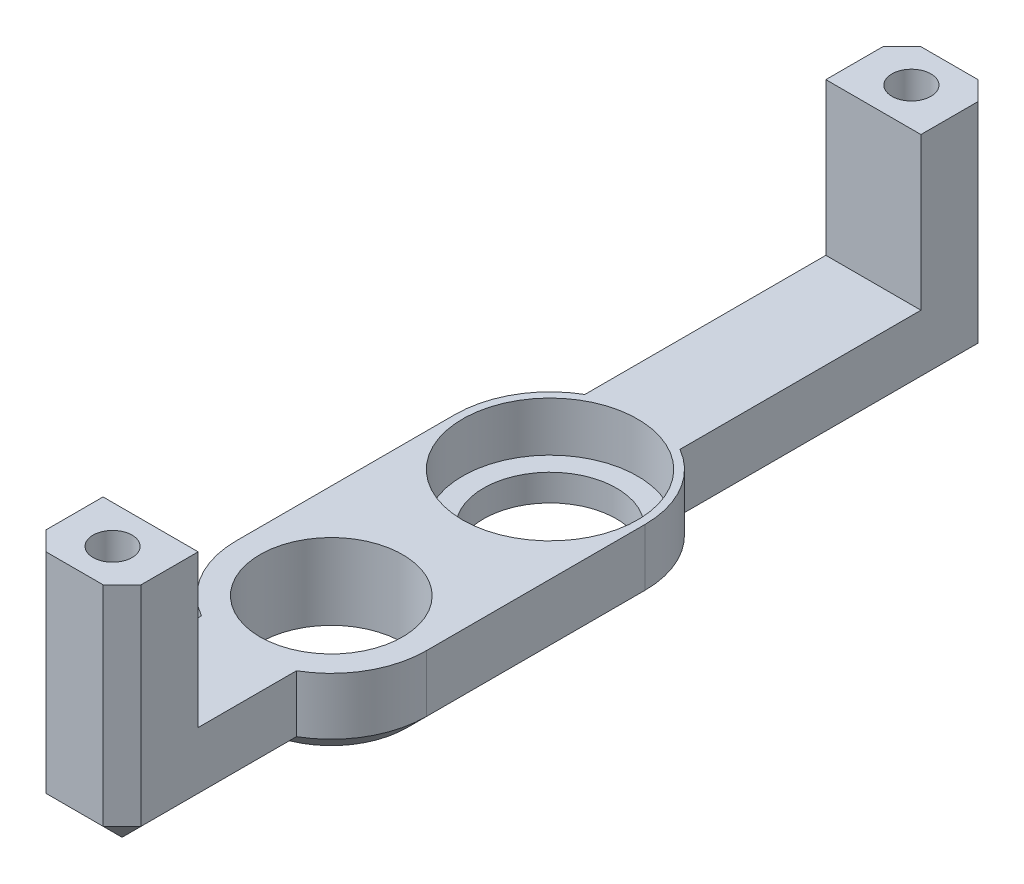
from build123d import *

# Parameters (mm, degrees)
ESBO_O2_W                                     = 10
ESBO_O2_H                                     = 46
RESSALTO_EXTRUS_O1_DEPTH                      = 4
CORTE_EXTRUS_O1_DEPTH                         = 48.244047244
FURO_DE_DI_METRO_7_5_7_5_1_D                  = 7.5
CORTE_EXTRUS_O2_DEPTH                         = 4
ESBO_O10_W                                    = 5
ESBO_O10_H                                    = 4
RESSALTO_EXTRUS_O2_DEPTH                      = 8
CHANFRO1_SIZE                                 = 1
BROCA_DE_ROSQUEAR_PARA_TARRAXA_DE_M2_51_D     = 2.05
BROCA_DE_ROSQUEAR_PARA_TARRAXA_DE_M2_51_DEPTH = 4
BROCA_DE_ROSQUEAR_PARA_TARRAXA_DE_M2_51_TIP   = 0.615882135
ESBO_O3_R                                     = 4.6
CORTE_EXTRUS_O3_DEPTH                         = 2.6
FURO_DE_DI_METRO_7_0_7_1_D                    = 7


with BuildPart() as part:
    # Esbo_o2 → Ressalto-extrus_o1 (new body)
    with BuildSketch(Plane(origin=(0, 0, 0), x_dir=(1, 0, 0), z_dir=(0, 1, 0))):
        with Locations((5, 23)):
            Rectangle(ESBO_O2_W, ESBO_O2_H)
    extrude(amount=RESSALTO_EXTRUS_O1_DEPTH)

    # Esbo_o6 → Corte-extrus_o1 (cut, through all)
    with BuildSketch(Plane(origin=(0, 4, 0), x_dir=(1, 0, 0), z_dir=(0, 1, 0))):
        with BuildLine():
            Line((2.5, 46), (2.5, 29.330127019))
            ThreePointArc((2.5, 29.330127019), (0.669872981, 27.5), (0, 25))
            Line((0, 25), (0, 46))
            Line((0, 46), (2.5, 46))
        make_face()
        with BuildLine():
            Line((7.5, 46), (7.5, 29.330127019))
            ThreePointArc((7.5, 29.330127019), (9.330127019, 27.5), (10, 25))
            Line((10, 25), (10, 46))
            Line((10, 46), (7.5, 46))
        make_face()
    extrude(amount=-CORTE_EXTRUS_O1_DEPTH, mode=Mode.SUBTRACT)

    # Furo de di_metro _7.5 _7.5_1 (through all)
    with Locations(Plane(origin=(5, 4, -13.5), x_dir=(0, 0, 1), z_dir=(0, 1, 0))):
        with Locations((0, 0)):
            Hole(FURO_DE_DI_METRO_7_5_7_5_1_D / 2)

    # Esbo_o9 → Corte-extrus_o2 (cut)
    with BuildSketch(Plane(origin=(0, 4, 0), x_dir=(1, 0, 0), z_dir=(0, 1, 0))):
        with BuildLine():
            Line((0, 13.5), (0, 0))
            Line((0, 0), (2.5, 0))
            Line((2.5, 0), (2.5, 9.169872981))
            ThreePointArc((2.5, 9.169872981), (0.669872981, 11), (0, 13.5))
        make_face()
        with BuildLine():
            Line((7.5, 0), (7.5, 9.169872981))
            ThreePointArc((7.5, 9.169872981), (9.330127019, 11), (10, 13.5))
            Line((10, 13.5), (10, 0))
            Line((10, 0), (7.5, 0))
        make_face()
    extrude(amount=-CORTE_EXTRUS_O2_DEPTH, mode=Mode.SUBTRACT)

    # Esbo_o10 → Ressalto-extrus_o2 (add)
    with BuildSketch(Plane(origin=(0, 4, 0), x_dir=(1, 0, 0), z_dir=(0, 1, 0))):
        with Locations((5, 44)):
            Rectangle(ESBO_O10_W, ESBO_O10_H)
        with Locations((5, 2)):
            Rectangle(ESBO_O10_W, ESBO_O10_H)
    extrude(amount=RESSALTO_EXTRUS_O2_DEPTH)

    # Chanfro1
    chanfro1_edges = [part.edges().sort_by_distance(p)[0] for p in [
        (0, 0, -19.25),
        (5, 0, -46),
        (7.5, 6, -46),
        (9.330127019, 0, -27.5),
        (7.5, 0, -37.665063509),
        (2.5, 0, -37.665063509),
        (2.5, 6, -46),
        (0.669872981, 0, -27.5),
        (10, 0, -19.25),
        (5, 0, 0),
        (0.669872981, 0, -11),
        (2.5, 0, -4.584936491),
        (2.5, 6, 0),
        (7.5, 0, -4.584936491),
        (7.5, 6, 0),
        (9.330127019, 0, -11),
    ]]
    chamfer(chanfro1_edges, length=CHANFRO1_SIZE)

    # Broca de rosquear para tarraxa de M2.51
    with Locations(Plane(origin=(5, 12, -2), x_dir=(0, 0, 1), z_dir=(0, 1, 0))):
        with Locations((0, 0), (-42, 0)):
            Hole(BROCA_DE_ROSQUEAR_PARA_TARRAXA_DE_M2_51_D / 2, depth=BROCA_DE_ROSQUEAR_PARA_TARRAXA_DE_M2_51_DEPTH)
            with Locations((0, 0, -(BROCA_DE_ROSQUEAR_PARA_TARRAXA_DE_M2_51_DEPTH + BROCA_DE_ROSQUEAR_PARA_TARRAXA_DE_M2_51_TIP / 2))):  # 118° drill point
                Cone(0, BROCA_DE_ROSQUEAR_PARA_TARRAXA_DE_M2_51_D / 2, BROCA_DE_ROSQUEAR_PARA_TARRAXA_DE_M2_51_TIP, mode=Mode.SUBTRACT)

    # Esbo_o3 → Corte-extrus_o3 (cut)
    with BuildSketch(Plane(origin=(0, 4, 0), x_dir=(1, 0, 0), z_dir=(0, 1, 0))):
        with Locations(Location((5, 25, 0), (0, 0, 270))):
            Circle(ESBO_O3_R)
    extrude(amount=-CORTE_EXTRUS_O3_DEPTH, mode=Mode.SUBTRACT)

    # Furo de di_metro _7.0 _7_1 (through all)
    with Locations(Plane(origin=(5, 4, -25), x_dir=(0, 0, 1), z_dir=(0, 1, 0))):
        with Locations((0, 0)):
            Hole(FURO_DE_DI_METRO_7_0_7_1_D / 2)


solid = part.part
